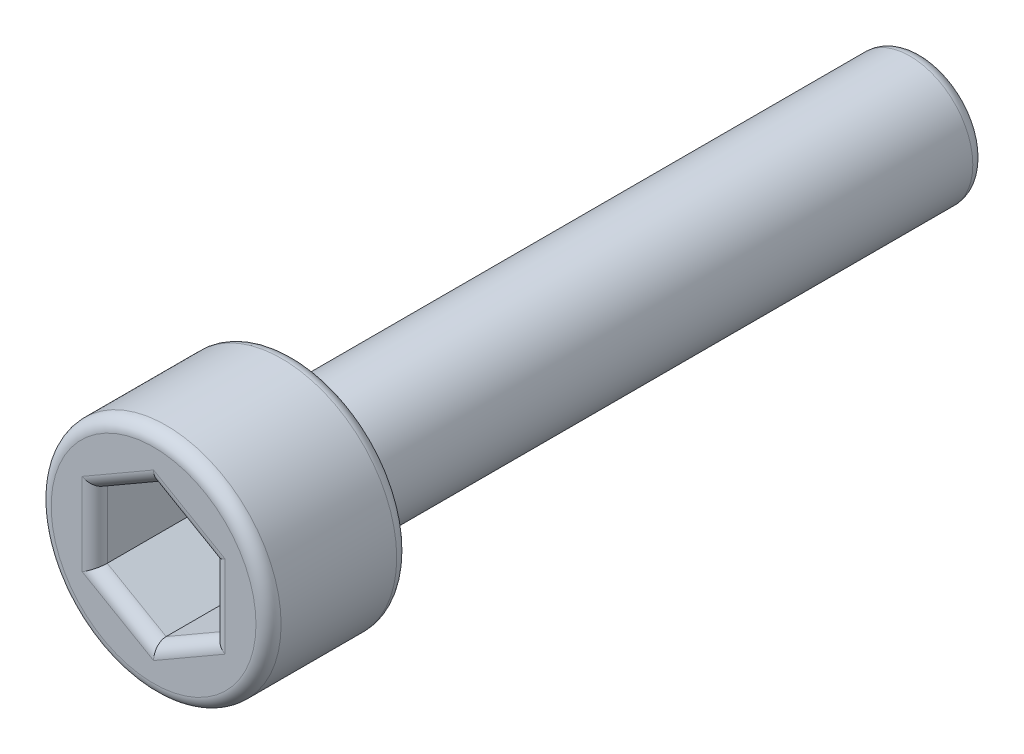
from build123d import *

# Parameters (mm, degrees)
SKETCH1_R          = 1.27
EXTRUDE1_DEPTH     = 12.7
SKETCH2_R          = 2.3241
EXTRUDE2_DEPTH     = 2.8448
CUT_EXTRUDE1_DEPTH = 2.032
FILLET1_R          = 0.254
FILLET2_R          = 0.254
FILLET3_R          = 0.254


with BuildPart() as part:
    # Sketch1 → Extrude1 (new body)
    with BuildSketch(Plane.XY):
        Circle(SKETCH1_R)
    extrude(amount=EXTRUDE1_DEPTH)

    # Sketch2 → Extrude2 (add)
    with BuildSketch(Plane.XY.offset(12.7)):
        Circle(SKETCH2_R)
    extrude(amount=EXTRUDE2_DEPTH)

    # Sketch3 → Cut-Extrude1 (cut)
    with BuildSketch(Plane.XY.offset(15.5448)):
        Polygon((0, -1.374815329), (1.190625, -0.687407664), (1.190625, 0.687407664), (0, 1.374815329), (-1.190625, 0.687407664), (-1.190625, -0.687407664), align=None)
    extrude(amount=-CUT_EXTRUDE1_DEPTH, mode=Mode.SUBTRACT)

    # Fillet1
    fillet1_edges = [part.edges().sort_by_distance(p)[0] for p in [
        (-0.5953125, -1.031111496, 15.5448),
        (0.5953125, -1.031111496, 15.5448),
        (1.190625, 0, 15.5448),
        (0.5953125, 1.031111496, 15.5448),
        (-0.5953125, 1.031111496, 15.5448),
        (-1.190625, 0, 15.5448),
    ]]
    fillet(fillet1_edges, radius=FILLET1_R)

    # Fillet2
    fillet2_edges = [part.edges().sort_by_distance(p)[0] for p in [
        (-2.3241, 0, 12.7),
        (-2.3241, 0, 15.5448),
    ]]
    fillet(fillet2_edges, radius=FILLET2_R)

    # Fillet3
    fillet3_edges = [part.edges().sort_by_distance(p)[0] for p in [
        (-1.27, 0, 0),
    ]]
    fillet(fillet3_edges, radius=FILLET3_R)


solid = part.part
